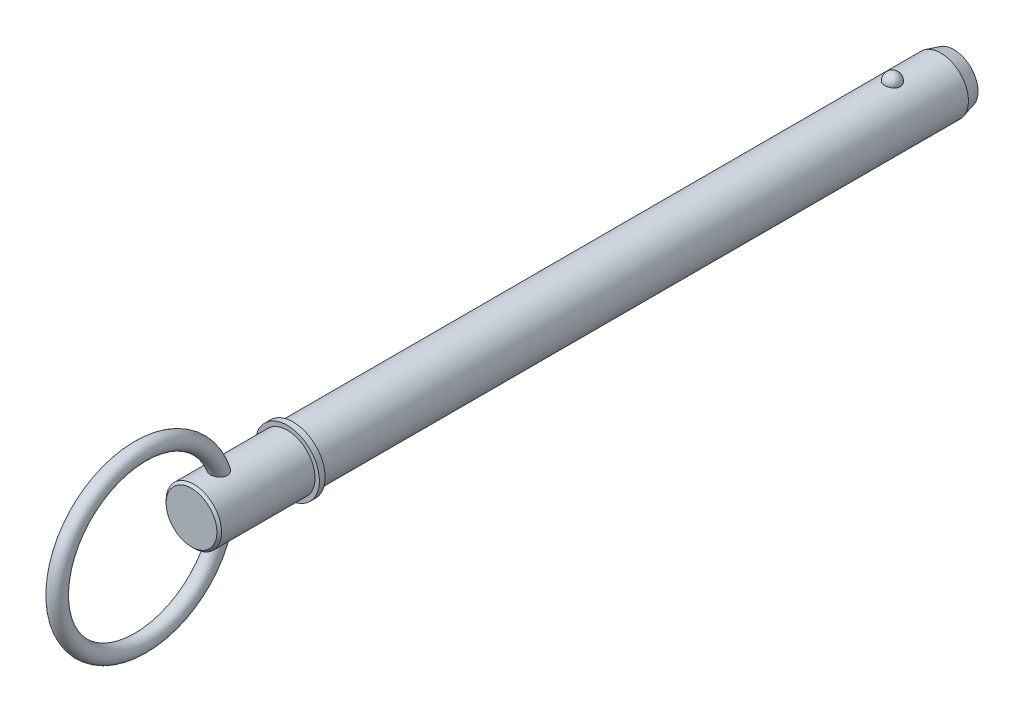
from build123d import *

# Parameters (mm, degrees)
SKETCH2_R           = 9.525
BOSS_EXTRUDE1_DEPTH = 203.2
BOSS_EXTRUDE2_START = 23.8
SKETCH3_R           = 9.525
BOSS_EXTRUDE2_DEPTH = 23.8
CHAMFER1_SIZE       = 4.5
CHAMFER1_SIZE2      = 1.205771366
SKETCH20_W          = 2
SKETCH20_H          = 11
SKETCH21_R          = 9.525
BOSS_EXTRUDE3_DEPTH = 34.93
CHAMFER2_SIZE       = 0.8
SKETCH24_R          = 2.75


with BuildPart() as part:
    # Sketch2 → Boss-Extrude1 (new body)
    with BuildSketch(Plane.XY):
        Circle(SKETCH2_R)
    extrude(amount=BOSS_EXTRUDE1_DEPTH)

    # Sketch3 → Boss-Extrude2 (add)
    with BuildSketch(Plane(origin=(0, 0, 0), x_dir=(-1, 0, 0), z_dir=(0, 0, -1)).offset(BOSS_EXTRUDE2_START)):
        Circle(SKETCH3_R)
    extrude(amount=-BOSS_EXTRUDE2_DEPTH)

    # Chamfer1
    chamfer1_edges = [part.edges().sort_by_distance(p)[0] for p in [
        (9.525, 0, -23.8),
    ]]
    chamfer1_side = [part.faces().sort_by_distance(p)[0] for p in [
        (9.525, 0, -11.9),
    ]]
    chamfer(chamfer1_edges, length=CHAMFER1_SIZE, length2=CHAMFER1_SIZE2, reference=chamfer1_side[0])

    # Sketch18 → Revolve1 (revolve)
    with BuildSketch(Plane(origin=(0, 0, 0), x_dir=(0, 0, -1), z_dir=(1, 0, 0))):
        with BuildLine():
            Line((2.69, 12.215), (2.69, 6.835))
            ThreePointArc((2.69, 6.835), (0, 9.525), (2.69, 12.215))
        make_face()
    revolve(axis=Axis((0, 12.215, -2.69), (0, -1, 0)))

    # Sketch20 → Revolve2 (revolve)
    with BuildSketch(Plane(origin=(0, 0, 0), x_dir=(0, 0, -1), z_dir=(1, 0, 0)), mode=Mode.PRIVATE) as revolve2_sk:
        with Locations((-204.2, 5.5)):
            Rectangle(SKETCH20_W, SKETCH20_H)
    revolve(revolve2_sk.sketch.rotate(Axis((0, 0, 33.728787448), (0, 0, 1)), 90), axis=Axis((0, 0, 33.728787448), (0, 0, 1)))

    # Sketch21 → Boss-Extrude3 (add)
    with BuildSketch(Plane(origin=(0, 0, 203.2), x_dir=(-1, 0, 0), z_dir=(0, 0, -1))):
        Circle(SKETCH21_R)
    extrude(amount=-BOSS_EXTRUDE3_DEPTH)

    # Chamfer2
    chamfer2_edges = [part.edges().sort_by_distance(p)[0] for p in [
        (9.525, 0, 238.13),
    ]]
    chamfer(chamfer2_edges, length=CHAMFER2_SIZE)

    # Sweep1: sweep along a path in Sketch23
    with BuildLine(Plane(origin=(0, 0, 0), x_dir=(0, 0, -1), z_dir=(1, 0, 0))) as sweep1_path:
        CenterArc((-255.705, 0), 28.575, 0, 360)
    # Sketch24 → Sweep1 (sweep)
    with BuildSketch(Plane(origin=(0, 0, 0), x_dir=(1, 0, 0), z_dir=(0, 1, 0))):
        with Locations((0, -227.13)):
            Circle(SKETCH24_R)
    sweep(path=sweep1_path.line)


solid = part.part
